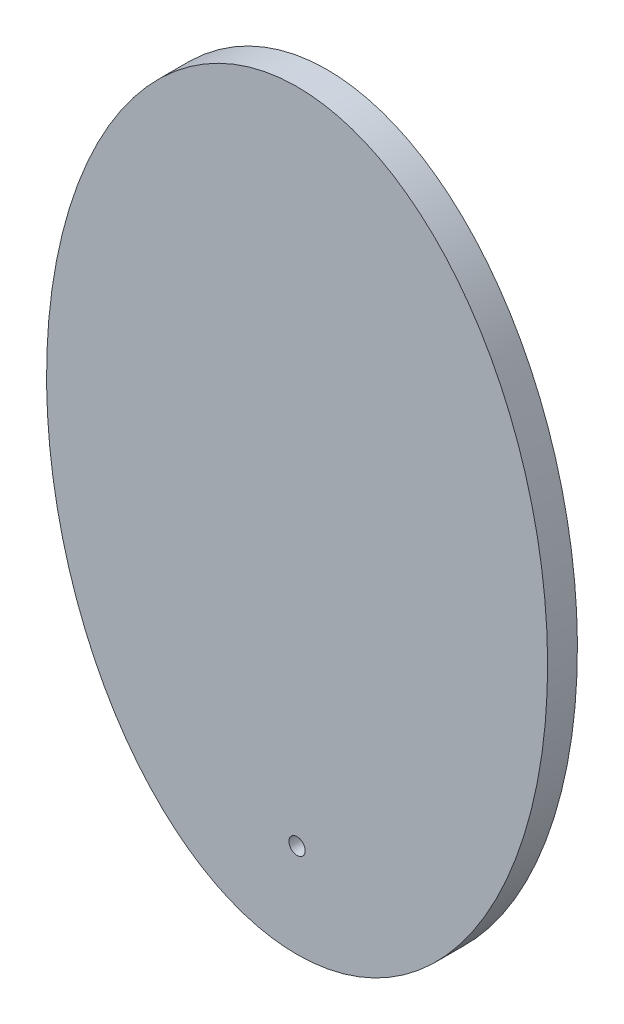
from build123d import *

# Parameters (mm, degrees)
SKETCH1_RX                                     = 60
SKETCH1_RY                                     = 40
F_3_16IN_CAST_CLEAR_ACRYLIC_DEPTH              = 4.7625
SKETCH2_R                                      = 1.65
LASER_RASTERED_M2_THREADED_INSERT_POCKET_DEPTH = 3
SKETCH3_R                                      = 2.25
LASER_RASTERED_PLASTIC_OVERFLOW_POCKET_DEPTH   = 0.5
SKETCH4_R                                      = 1.3
LASER_CUT_HOLE_TAPPED_M3_DEPTH                 = 73.268121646


with BuildPart() as part:
    # Sketch1 → 3_16in cast clear acrylic (new body)
    with BuildSketch(Plane.XY):
        with Locations(Location((0, 0), (0, 0, -90))):
            Ellipse(SKETCH1_RX, SKETCH1_RY)
    extrude(amount=-F_3_16IN_CAST_CLEAR_ACRYLIC_DEPTH)

    # Sketch2 → laser rastered M2 threaded insert pocket (cut)
    with BuildSketch(Plane(origin=(0, 0, -4.7625), x_dir=(1, 0, 0), z_dir=(0, 0, -1))):
        with Locations(Location((26.880889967, -40, 0), (0, 0, 270))):
            Circle(SKETCH2_R)
        with Locations(Location((-26.879913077, -40, 0), (0, 0, 270))):
            Circle(SKETCH2_R)
        with Locations(Location((-31.954999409, 30, 0), (0, 0, 270))):
            Circle(SKETCH2_R)
        with Locations(Location((31.95503572, 30, 0), (0, 0, 270))):
            Circle(SKETCH2_R)
    extrude(amount=-LASER_RASTERED_M2_THREADED_INSERT_POCKET_DEPTH, mode=Mode.SUBTRACT)

    # Sketch3 → laser rastered plastic overflow pocket (cut)
    with BuildSketch(Plane(origin=(0, 0, -4.7625), x_dir=(1, 0, 0), z_dir=(0, 0, -1))):
        with Locations(Location((26.880889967, -40, 0), (0, 0, 270))):
            Circle(SKETCH3_R)
        with Locations(Location((-26.879913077, -40, 0), (0, 0, 270))):
            Circle(SKETCH3_R)
        with Locations(Location((-31.954999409, 30, 0), (0, 0, 270))):
            Circle(SKETCH3_R)
        with Locations(Location((31.95503572, 30, 0), (0, 0, 270))):
            Circle(SKETCH3_R)
    extrude(amount=-LASER_RASTERED_PLASTIC_OVERFLOW_POCKET_DEPTH, mode=Mode.SUBTRACT)

    # Sketch4 → laser cut hole_ tapped_ M3 (cut, through all)
    with BuildSketch(Plane(origin=(0, 0, -4.7625), x_dir=(1, 0, 0), z_dir=(0, 0, -1))):
        with Locations(Location((0, 45, 0), (0, 0, 270))):
            Circle(SKETCH4_R)
    extrude(amount=-LASER_CUT_HOLE_TAPPED_M3_DEPTH, mode=Mode.SUBTRACT)


solid = part.part
